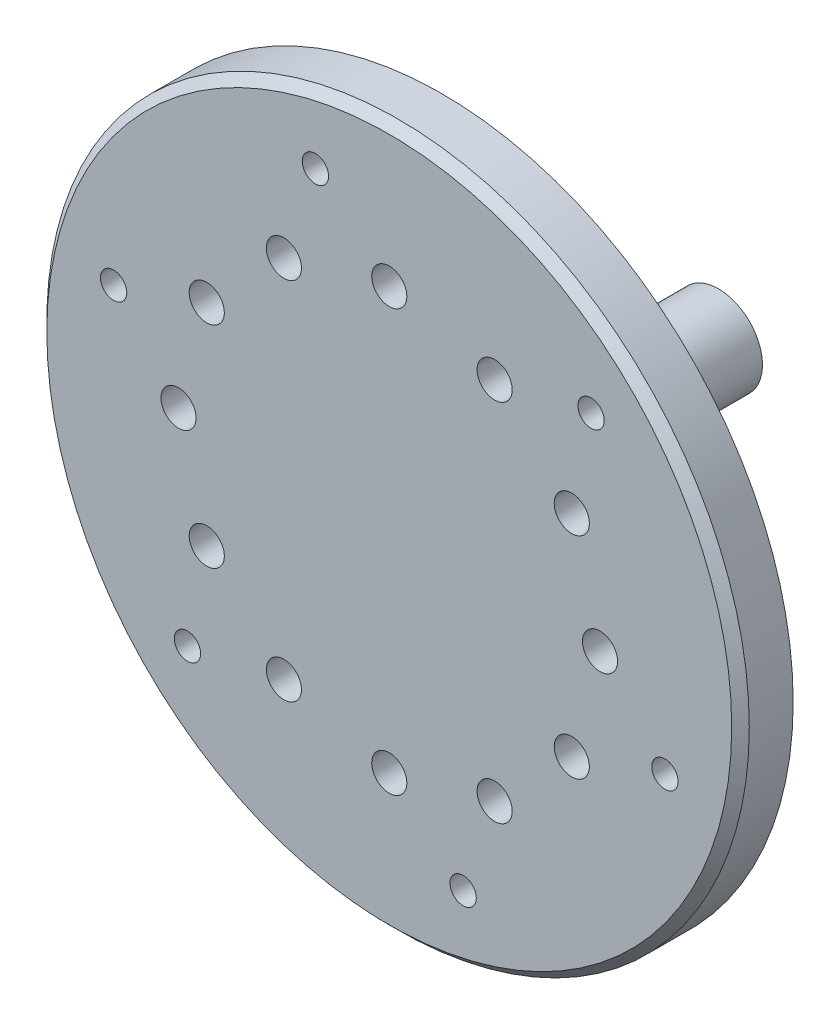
ISO-10303-21;
HEADER;
FILE_DESCRIPTION(('STEP AP214'),'2;1');
FILE_NAME('part.step','',(''),(''),'','','');
FILE_SCHEMA(('AUTOMOTIVE_DESIGN { 1 0 10303 214 1 1 1 1 }'));
ENDSEC;
DATA;
#1=APPLICATION_CONTEXT('core data for automotive mechanical design processes');
#2=APPLICATION_PROTOCOL_DEFINITION('international standard','automotive_design',2000,#1);
#3=PRODUCT_CONTEXT('',#1,'mechanical');
#4=PRODUCT('Part','Part','',(#3));
#5=PRODUCT_RELATED_PRODUCT_CATEGORY('part','',(#4));
#6=PRODUCT_DEFINITION_FORMATION('','',#4);
#7=PRODUCT_DEFINITION_CONTEXT('part definition',#1,'design');
#8=PRODUCT_DEFINITION('design','',#6,#7);
#9=PRODUCT_DEFINITION_SHAPE('','',#8);
#10=(LENGTH_UNIT() NAMED_UNIT(*) SI_UNIT(.MILLI.,.METRE.));
#11=(NAMED_UNIT(*) PLANE_ANGLE_UNIT() SI_UNIT($,.RADIAN.));
#12=(NAMED_UNIT(*) SI_UNIT($,.STERADIAN.) SOLID_ANGLE_UNIT());
#13=UNCERTAINTY_MEASURE_WITH_UNIT(LENGTH_MEASURE(1.E-05),#10,'distance_accuracy_value','');
#14=(GEOMETRIC_REPRESENTATION_CONTEXT(3) GLOBAL_UNCERTAINTY_ASSIGNED_CONTEXT((#13)) GLOBAL_UNIT_ASSIGNED_CONTEXT((#10,
#11,#12)) REPRESENTATION_CONTEXT('',''));
#15=CARTESIAN_POINT('',(0.,0.,0.));
#16=DIRECTION('',(0.,0.,1.));
#17=DIRECTION('',(1.,0.,0.));
#18=AXIS2_PLACEMENT_3D('',#15,#16,#17);
#19=CARTESIAN_POINT('',(0.,0.,-9.99999999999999));
#20=DIRECTION('',(0.,0.,-1.));
#21=DIRECTION('',(-1.,0.,0.));
#22=AXIS2_PLACEMENT_3D('',#19,#20,#21);
#23=PLANE('',#22);
#24=CARTESIAN_POINT('',(0.,0.,-9.99999999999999));
#25=DIRECTION('',(0.,0.,-1.));
#26=DIRECTION('',(-1.,0.,0.));
#27=AXIS2_PLACEMENT_3D('',#24,#25,#26);
#28=CIRCLE('',#27,12.5);
#29=CARTESIAN_POINT('',(-12.5,0.,-9.99999999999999));
#30=VERTEX_POINT('',#29);
#31=EDGE_CURVE('E42',#30,#30,#28,.T.);
#32=ORIENTED_EDGE('',*,*,#31,.T.);
#33=EDGE_LOOP('',(#32));
#34=FACE_BOUND('',#33,.T.);
#35=CARTESIAN_POINT('',(0.,0.,-9.99999999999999));
#36=DIRECTION('',(0.,0.,-1.));
#37=DIRECTION('',(-1.,0.,0.));
#38=AXIS2_PLACEMENT_3D('',#35,#36,#37);
#39=CIRCLE('',#38,10.);
#40=CARTESIAN_POINT('',(-10.,0.,-9.99999999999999));
#41=VERTEX_POINT('',#40);
#42=EDGE_CURVE('E156',#41,#41,#39,.T.);
#43=ORIENTED_EDGE('',*,*,#42,.F.);
#44=EDGE_LOOP('',(#43));
#45=FACE_BOUND('',#44,.T.);
#46=ADVANCED_FACE('F22',(#34,#45),#23,.T.);
#47=CARTESIAN_POINT('',(0.,0.,0.));
#48=DIRECTION('',(0.,0.,1.));
#49=DIRECTION('',(1.,0.,0.));
#50=AXIS2_PLACEMENT_3D('',#47,#48,#49);
#51=PLANE('',#50);
#52=CARTESIAN_POINT('',(-45.9619407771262,-45.961940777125,0.));
#53=DIRECTION('',(0.,0.,1.));
#54=DIRECTION('',(1.,0.,0.));
#55=AXIS2_PLACEMENT_3D('',#52,#53,#54);
#56=CIRCLE('',#55,3.);
#57=CARTESIAN_POINT('',(-42.9619407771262,-45.961940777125,0.));
#58=VERTEX_POINT('',#57);
#59=EDGE_CURVE('E147',#58,#58,#56,.T.);
#60=ORIENTED_EDGE('',*,*,#59,.T.);
#61=EDGE_LOOP('',(#60));
#62=FACE_BOUND('',#61,.T.);
#63=CARTESIAN_POINT('',(16.8232379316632,-62.7851787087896,0.));
#64=DIRECTION('',(0.,0.,1.));
#65=DIRECTION('',(1.,0.,0.));
#66=AXIS2_PLACEMENT_3D('',#63,#64,#65);
#67=CIRCLE('',#66,3.);
#68=CARTESIAN_POINT('',(19.8232379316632,-62.7851787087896,0.));
#69=VERTEX_POINT('',#68);
#70=EDGE_CURVE('E141',#69,#69,#67,.T.);
#71=ORIENTED_EDGE('',*,*,#70,.T.);
#72=EDGE_LOOP('',(#71));
#73=FACE_BOUND('',#72,.T.);
#74=CARTESIAN_POINT('',(62.7851787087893,-16.8232379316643,0.));
#75=DIRECTION('',(0.,0.,1.));
#76=DIRECTION('',(1.,0.,0.));
#77=AXIS2_PLACEMENT_3D('',#74,#75,#76);
#78=CIRCLE('',#77,3.);
#79=CARTESIAN_POINT('',(65.7851787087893,-16.8232379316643,0.));
#80=VERTEX_POINT('',#79);
#81=EDGE_CURVE('E135',#80,#80,#78,.T.);
#82=ORIENTED_EDGE('',*,*,#81,.T.);
#83=EDGE_LOOP('',(#82));
#84=FACE_BOUND('',#83,.T.);
#85=CARTESIAN_POINT('',(45.9619407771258,45.9619407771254,0.));
#86=DIRECTION('',(0.,0.,1.));
#87=DIRECTION('',(1.,0.,0.));
#88=AXIS2_PLACEMENT_3D('',#85,#86,#87);
#89=CIRCLE('',#88,3.);
#90=CARTESIAN_POINT('',(48.9619407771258,45.9619407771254,0.));
#91=VERTEX_POINT('',#90);
#92=EDGE_CURVE('E129',#91,#91,#89,.T.);
#93=ORIENTED_EDGE('',*,*,#92,.T.);
#94=EDGE_LOOP('',(#93));
#95=FACE_BOUND('',#94,.T.);
#96=CARTESIAN_POINT('',(-16.8232379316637,62.7851787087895,0.));
#97=DIRECTION('',(0.,0.,1.));
#98=DIRECTION('',(1.,0.,0.));
#99=AXIS2_PLACEMENT_3D('',#96,#97,#98);
#100=CIRCLE('',#99,3.);
#101=CARTESIAN_POINT('',(-13.8232379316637,62.7851787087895,0.));
#102=VERTEX_POINT('',#101);
#103=EDGE_CURVE('E123',#102,#102,#100,.T.);
#104=ORIENTED_EDGE('',*,*,#103,.T.);
#105=EDGE_LOOP('',(#104));
#106=FACE_BOUND('',#105,.T.);
#107=CARTESIAN_POINT('',(-62.7851787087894,16.8232379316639,0.));
#108=DIRECTION('',(0.,0.,1.));
#109=DIRECTION('',(1.,0.,0.));
#110=AXIS2_PLACEMENT_3D('',#107,#108,#109);
#111=CIRCLE('',#110,3.);
#112=CARTESIAN_POINT('',(-59.7851787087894,16.8232379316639,0.));
#113=VERTEX_POINT('',#112);
#114=EDGE_CURVE('E117',#113,#113,#111,.T.);
#115=ORIENTED_EDGE('',*,*,#114,.T.);
#116=EDGE_LOOP('',(#115));
#117=FACE_BOUND('',#116,.T.);
#118=CARTESIAN_POINT('',(-41.5692193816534,23.9999999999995,0.));
#119=DIRECTION('',(0.,0.,1.));
#120=DIRECTION('',(1.,0.,0.));
#121=AXIS2_PLACEMENT_3D('',#118,#119,#120);
#122=CIRCLE('',#121,4.);
#123=CARTESIAN_POINT('',(-37.5692193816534,23.9999999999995,0.));
#124=VERTEX_POINT('',#123);
#125=EDGE_CURVE('E111',#124,#124,#122,.T.);
#126=ORIENTED_EDGE('',*,*,#125,.T.);
#127=EDGE_LOOP('',(#126));
#128=FACE_BOUND('',#127,.T.);
#129=CARTESIAN_POINT('',(-24.0000000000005,41.5692193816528,0.));
#130=DIRECTION('',(0.,0.,1.));
#131=DIRECTION('',(1.,0.,0.));
#132=AXIS2_PLACEMENT_3D('',#129,#130,#131);
#133=CIRCLE('',#132,4.);
#134=CARTESIAN_POINT('',(-20.0000000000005,41.5692193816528,0.));
#135=VERTEX_POINT('',#134);
#136=EDGE_CURVE('E105',#135,#135,#133,.T.);
#137=ORIENTED_EDGE('',*,*,#136,.T.);
#138=EDGE_LOOP('',(#137));
#139=FACE_BOUND('',#138,.T.);
#140=CARTESIAN_POINT('',(-5.02773603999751E-13,48.,0.));
#141=DIRECTION('',(0.,0.,1.));
#142=DIRECTION('',(1.,0.,0.));
#143=AXIS2_PLACEMENT_3D('',#140,#141,#142);
#144=CIRCLE('',#143,4.);
#145=CARTESIAN_POINT('',(3.9999999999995,48.,0.));
#146=VERTEX_POINT('',#145);
#147=EDGE_CURVE('E99',#146,#146,#144,.T.);
#148=ORIENTED_EDGE('',*,*,#147,.T.);
#149=EDGE_LOOP('',(#148));
#150=FACE_BOUND('',#149,.T.);
#151=CARTESIAN_POINT('',(23.9999999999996,41.5692193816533,0.));
#152=DIRECTION('',(0.,0.,1.));
#153=DIRECTION('',(1.,0.,0.));
#154=AXIS2_PLACEMENT_3D('',#151,#152,#153);
#155=CIRCLE('',#154,4.);
#156=CARTESIAN_POINT('',(27.9999999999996,41.5692193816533,0.));
#157=VERTEX_POINT('',#156);
#158=EDGE_CURVE('E93',#157,#157,#155,.T.);
#159=ORIENTED_EDGE('',*,*,#158,.T.);
#160=EDGE_LOOP('',(#159));
#161=FACE_BOUND('',#160,.T.);
#162=CARTESIAN_POINT('',(41.5692193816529,24.0000000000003,0.));
#163=DIRECTION('',(0.,0.,1.));
#164=DIRECTION('',(1.,0.,0.));
#165=AXIS2_PLACEMENT_3D('',#162,#163,#164);
#166=CIRCLE('',#165,4.);
#167=CARTESIAN_POINT('',(45.5692193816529,24.0000000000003,0.));
#168=VERTEX_POINT('',#167);
#169=EDGE_CURVE('E87',#168,#168,#166,.T.);
#170=ORIENTED_EDGE('',*,*,#169,.T.);
#171=EDGE_LOOP('',(#170));
#172=FACE_BOUND('',#171,.T.);
#173=CARTESIAN_POINT('',(48.,3.35182402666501E-13,0.));
#174=DIRECTION('',(0.,0.,1.));
#175=DIRECTION('',(1.,0.,0.));
#176=AXIS2_PLACEMENT_3D('',#173,#174,#175);
#177=CIRCLE('',#176,4.);
#178=CARTESIAN_POINT('',(52.,3.35182402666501E-13,0.));
#179=VERTEX_POINT('',#178);
#180=EDGE_CURVE('E81',#179,#179,#177,.T.);
#181=ORIENTED_EDGE('',*,*,#180,.T.);
#182=EDGE_LOOP('',(#181));
#183=FACE_BOUND('',#182,.T.);
#184=CARTESIAN_POINT('',(41.5692193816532,-23.9999999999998,0.));
#185=DIRECTION('',(0.,0.,1.));
#186=DIRECTION('',(1.,0.,0.));
#187=AXIS2_PLACEMENT_3D('',#184,#185,#186);
#188=CIRCLE('',#187,4.);
#189=CARTESIAN_POINT('',(45.5692193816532,-23.9999999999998,0.));
#190=VERTEX_POINT('',#189);
#191=EDGE_CURVE('E75',#190,#190,#188,.T.);
#192=ORIENTED_EDGE('',*,*,#191,.T.);
#193=EDGE_LOOP('',(#192));
#194=FACE_BOUND('',#193,.T.);
#195=CARTESIAN_POINT('',(24.0000000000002,-41.5692193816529,0.));
#196=DIRECTION('',(0.,0.,1.));
#197=DIRECTION('',(1.,0.,0.));
#198=AXIS2_PLACEMENT_3D('',#195,#196,#197);
#199=CIRCLE('',#198,4.);
#200=CARTESIAN_POINT('',(28.0000000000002,-41.5692193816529,0.));
#201=VERTEX_POINT('',#200);
#202=EDGE_CURVE('E69',#201,#201,#199,.T.);
#203=ORIENTED_EDGE('',*,*,#202,.T.);
#204=EDGE_LOOP('',(#203));
#205=FACE_BOUND('',#204,.T.);
#206=CARTESIAN_POINT('',(1.6759120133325E-13,-48.,0.));
#207=DIRECTION('',(0.,0.,1.));
#208=DIRECTION('',(1.,0.,0.));
#209=AXIS2_PLACEMENT_3D('',#206,#207,#208);
#210=CIRCLE('',#209,4.);
#211=CARTESIAN_POINT('',(4.00000000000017,-48.,0.));
#212=VERTEX_POINT('',#211);
#213=EDGE_CURVE('E63',#212,#212,#210,.T.);
#214=ORIENTED_EDGE('',*,*,#213,.T.);
#215=EDGE_LOOP('',(#214));
#216=FACE_BOUND('',#215,.T.);
#217=CARTESIAN_POINT('',(-23.9999999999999,-41.5692193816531,0.));
#218=DIRECTION('',(0.,0.,1.));
#219=DIRECTION('',(1.,0.,0.));
#220=AXIS2_PLACEMENT_3D('',#217,#218,#219);
#221=CIRCLE('',#220,4.);
#222=CARTESIAN_POINT('',(-19.9999999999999,-41.5692193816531,0.));
#223=VERTEX_POINT('',#222);
#224=EDGE_CURVE('E57',#223,#223,#221,.T.);
#225=ORIENTED_EDGE('',*,*,#224,.T.);
#226=EDGE_LOOP('',(#225));
#227=FACE_BOUND('',#226,.T.);
#228=CARTESIAN_POINT('',(-41.569219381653,-24.0000000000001,0.));
#229=DIRECTION('',(0.,0.,1.));
#230=DIRECTION('',(1.,0.,0.));
#231=AXIS2_PLACEMENT_3D('',#228,#229,#230);
#232=CIRCLE('',#231,4.);
#233=CARTESIAN_POINT('',(-37.569219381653,-24.0000000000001,0.));
#234=VERTEX_POINT('',#233);
#235=EDGE_CURVE('E51',#234,#234,#232,.T.);
#236=ORIENTED_EDGE('',*,*,#235,.T.);
#237=EDGE_LOOP('',(#236));
#238=FACE_BOUND('',#237,.T.);
#239=CARTESIAN_POINT('',(-48.,0.,0.));
#240=DIRECTION('',(0.,0.,1.));
#241=DIRECTION('',(1.,0.,0.));
#242=AXIS2_PLACEMENT_3D('',#239,#240,#241);
#243=CIRCLE('',#242,4.);
#244=CARTESIAN_POINT('',(-44.,0.,0.));
#245=VERTEX_POINT('',#244);
#246=EDGE_CURVE('E45',#245,#245,#243,.T.);
#247=ORIENTED_EDGE('',*,*,#246,.T.);
#248=EDGE_LOOP('',(#247));
#249=FACE_BOUND('',#248,.T.);
#250=CARTESIAN_POINT('',(0.,0.,0.));
#251=DIRECTION('',(0.,0.,1.));
#252=DIRECTION('',(1.,0.,0.));
#253=AXIS2_PLACEMENT_3D('',#250,#251,#252);
#254=CIRCLE('',#253,80.);
#255=CARTESIAN_POINT('',(80.,0.,0.));
#256=VERTEX_POINT('',#255);
#257=EDGE_CURVE('E37',#256,#256,#254,.T.);
#258=ORIENTED_EDGE('',*,*,#257,.F.);
#259=EDGE_LOOP('',(#258));
#260=FACE_BOUND('',#259,.T.);
#261=CARTESIAN_POINT('',(0.,0.,0.));
#262=DIRECTION('',(0.,0.,1.));
#263=DIRECTION('',(1.,0.,0.));
#264=AXIS2_PLACEMENT_3D('',#261,#262,#263);
#265=CIRCLE('',#264,12.5);
#266=CARTESIAN_POINT('',(12.5,0.,0.));
#267=VERTEX_POINT('',#266);
#268=EDGE_CURVE('E10',#267,#267,#265,.F.);
#269=ORIENTED_EDGE('',*,*,#268,.F.);
#270=EDGE_LOOP('',(#269));
#271=FACE_BOUND('',#270,.T.);
#272=ADVANCED_FACE('F163',(#62,#73,#84,#95,#106,#117,#128,#139,#150,#161,#172,#183,#194,#205,
#216,#227,#238,#249,#260,#271),#51,.F.);
#273=CARTESIAN_POINT('',(0.,0.,12.));
#274=DIRECTION('',(0.,0.,-1.));
#275=DIRECTION('',(-1.,0.,0.));
#276=AXIS2_PLACEMENT_3D('',#273,#274,#275);
#277=CYLINDRICAL_SURFACE('',#276,80.);
#278=CARTESIAN_POINT('',(0.,0.,9.99999999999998));
#279=DIRECTION('',(0.,0.,1.));
#280=DIRECTION('',(1.,0.,0.));
#281=AXIS2_PLACEMENT_3D('',#278,#279,#280);
#282=CIRCLE('',#281,80.);
#283=CARTESIAN_POINT('',(80.,0.,9.99999999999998));
#284=VERTEX_POINT('',#283);
#285=EDGE_CURVE('E29',#284,#284,#282,.F.);
#286=ORIENTED_EDGE('',*,*,#285,.T.);
#287=EDGE_LOOP('',(#286));
#288=FACE_BOUND('',#287,.T.);
#289=ORIENTED_EDGE('',*,*,#257,.T.);
#290=EDGE_LOOP('',(#289));
#291=FACE_BOUND('',#290,.T.);
#292=ADVANCED_FACE('F24',(#288,#291),#277,.T.);
#293=CARTESIAN_POINT('',(0.,0.,12.));
#294=DIRECTION('',(0.,0.,1.));
#295=DIRECTION('',(1.,0.,0.));
#296=AXIS2_PLACEMENT_3D('',#293,#294,#295);
#297=PLANE('',#296);
#298=CARTESIAN_POINT('',(-45.9619407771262,-45.961940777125,12.));
#299=DIRECTION('',(0.,0.,1.));
#300=DIRECTION('',(0.50000000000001,0.866025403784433,0.));
#301=AXIS2_PLACEMENT_3D('',#298,#299,#300);
#302=CIRCLE('',#301,3.);
#303=CARTESIAN_POINT('',(-44.4619407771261,-43.3638645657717,12.));
#304=VERTEX_POINT('',#303);
#305=EDGE_CURVE('E150',#304,#304,#302,.T.);
#306=ORIENTED_EDGE('',*,*,#305,.F.);
#307=EDGE_LOOP('',(#306));
#308=FACE_BOUND('',#307,.T.);
#309=CARTESIAN_POINT('',(16.8232379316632,-62.7851787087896,12.));
#310=DIRECTION('',(0.,0.,1.));
#311=DIRECTION('',(-0.499999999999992,0.866025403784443,0.));
#312=AXIS2_PLACEMENT_3D('',#309,#310,#311);
#313=CIRCLE('',#312,3.);
#314=CARTESIAN_POINT('',(15.3232379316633,-60.1871024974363,12.));
#315=VERTEX_POINT('',#314);
#316=EDGE_CURVE('E144',#315,#315,#313,.T.);
#317=ORIENTED_EDGE('',*,*,#316,.F.);
#318=EDGE_LOOP('',(#317));
#319=FACE_BOUND('',#318,.T.);
#320=CARTESIAN_POINT('',(62.7851787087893,-16.8232379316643,12.));
#321=DIRECTION('',(0.,0.,1.));
#322=DIRECTION('',(-1.,0.,0.));
#323=AXIS2_PLACEMENT_3D('',#320,#321,#322);
#324=CIRCLE('',#323,3.);
#325=CARTESIAN_POINT('',(59.7851787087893,-16.8232379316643,12.));
#326=VERTEX_POINT('',#325);
#327=EDGE_CURVE('E138',#326,#326,#324,.T.);
#328=ORIENTED_EDGE('',*,*,#327,.F.);
#329=EDGE_LOOP('',(#328));
#330=FACE_BOUND('',#329,.T.);
#331=CARTESIAN_POINT('',(45.9619407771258,45.9619407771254,12.));
#332=DIRECTION('',(0.,0.,1.));
#333=DIRECTION('',(-0.500000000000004,-0.866025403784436,0.));
#334=AXIS2_PLACEMENT_3D('',#331,#332,#333);
#335=CIRCLE('',#334,3.);
#336=CARTESIAN_POINT('',(44.4619407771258,43.363864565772,12.));
#337=VERTEX_POINT('',#336);
#338=EDGE_CURVE('E132',#337,#337,#335,.T.);
#339=ORIENTED_EDGE('',*,*,#338,.F.);
#340=EDGE_LOOP('',(#339));
#341=FACE_BOUND('',#340,.T.);
#342=CARTESIAN_POINT('',(-16.8232379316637,62.7851787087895,12.));
#343=DIRECTION('',(0.,0.,1.));
#344=DIRECTION('',(0.499999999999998,-0.86602540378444,0.));
#345=AXIS2_PLACEMENT_3D('',#342,#343,#344);
#346=CIRCLE('',#345,3.);
#347=CARTESIAN_POINT('',(-15.3232379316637,60.1871024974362,12.));
#348=VERTEX_POINT('',#347);
#349=EDGE_CURVE('E126',#348,#348,#346,.T.);
#350=ORIENTED_EDGE('',*,*,#349,.F.);
#351=EDGE_LOOP('',(#350));
#352=FACE_BOUND('',#351,.T.);
#353=CARTESIAN_POINT('',(-62.7851787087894,16.8232379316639,12.));
#354=DIRECTION('',(0.,0.,1.));
#355=DIRECTION('',(1.,0.,0.));
#356=AXIS2_PLACEMENT_3D('',#353,#354,#355);
#357=CIRCLE('',#356,3.);
#358=CARTESIAN_POINT('',(-59.7851787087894,16.8232379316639,12.));
#359=VERTEX_POINT('',#358);
#360=EDGE_CURVE('E120',#359,#359,#357,.T.);
#361=ORIENTED_EDGE('',*,*,#360,.F.);
#362=EDGE_LOOP('',(#361));
#363=FACE_BOUND('',#362,.T.);
#364=CARTESIAN_POINT('',(-41.5692193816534,23.9999999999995,12.));
#365=DIRECTION('',(0.,0.,1.));
#366=DIRECTION('',(0.866025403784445,-0.499999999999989,0.));
#367=AXIS2_PLACEMENT_3D('',#364,#365,#366);
#368=CIRCLE('',#367,4.);
#369=CARTESIAN_POINT('',(-38.1051177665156,21.9999999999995,12.));
#370=VERTEX_POINT('',#369);
#371=EDGE_CURVE('E114',#370,#370,#368,.T.);
#372=ORIENTED_EDGE('',*,*,#371,.F.);
#373=EDGE_LOOP('',(#372));
#374=FACE_BOUND('',#373,.T.);
#375=CARTESIAN_POINT('',(-24.0000000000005,41.5692193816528,12.));
#376=DIRECTION('',(0.,0.,1.));
#377=DIRECTION('',(0.50000000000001,-0.866025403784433,0.));
#378=AXIS2_PLACEMENT_3D('',#375,#376,#377);
#379=CIRCLE('',#378,4.);
#380=CARTESIAN_POINT('',(-22.0000000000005,38.1051177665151,12.));
#381=VERTEX_POINT('',#380);
#382=EDGE_CURVE('E108',#381,#381,#379,.T.);
#383=ORIENTED_EDGE('',*,*,#382,.F.);
#384=EDGE_LOOP('',(#383));
#385=FACE_BOUND('',#384,.T.);
#386=CARTESIAN_POINT('',(-5.02773603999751E-13,48.,12.));
#387=DIRECTION('',(0.,0.,1.));
#388=DIRECTION('',(0.,-1.,0.));
#389=AXIS2_PLACEMENT_3D('',#386,#387,#388);
#390=CIRCLE('',#389,4.);
#391=CARTESIAN_POINT('',(-4.60875803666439E-13,44.,12.));
#392=VERTEX_POINT('',#391);
#393=EDGE_CURVE('E102',#392,#392,#390,.T.);
#394=ORIENTED_EDGE('',*,*,#393,.F.);
#395=EDGE_LOOP('',(#394));
#396=FACE_BOUND('',#395,.T.);
#397=CARTESIAN_POINT('',(23.9999999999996,41.5692193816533,12.));
#398=DIRECTION('',(0.,0.,1.));
#399=DIRECTION('',(-0.499999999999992,-0.866025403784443,0.));
#400=AXIS2_PLACEMENT_3D('',#397,#398,#399);
#401=CIRCLE('',#400,4.);
#402=CARTESIAN_POINT('',(21.9999999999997,38.1051177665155,12.));
#403=VERTEX_POINT('',#402);
#404=EDGE_CURVE('E96',#403,#403,#401,.T.);
#405=ORIENTED_EDGE('',*,*,#404,.F.);
#406=EDGE_LOOP('',(#405));
#407=FACE_BOUND('',#406,.T.);
#408=CARTESIAN_POINT('',(41.5692193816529,24.0000000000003,12.));
#409=DIRECTION('',(0.,0.,1.));
#410=DIRECTION('',(-0.866025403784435,-0.500000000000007,0.));
#411=AXIS2_PLACEMENT_3D('',#408,#409,#410);
#412=CIRCLE('',#411,4.);
#413=CARTESIAN_POINT('',(38.1051177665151,22.0000000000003,12.));
#414=VERTEX_POINT('',#413);
#415=EDGE_CURVE('E90',#414,#414,#412,.T.);
#416=ORIENTED_EDGE('',*,*,#415,.F.);
#417=EDGE_LOOP('',(#416));
#418=FACE_BOUND('',#417,.T.);
#419=CARTESIAN_POINT('',(48.,3.35182402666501E-13,12.));
#420=DIRECTION('',(0.,0.,1.));
#421=DIRECTION('',(-1.,0.,0.));
#422=AXIS2_PLACEMENT_3D('',#419,#420,#421);
#423=CIRCLE('',#422,4.);
#424=CARTESIAN_POINT('',(44.,3.07250535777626E-13,12.));
#425=VERTEX_POINT('',#424);
#426=EDGE_CURVE('E84',#425,#425,#423,.T.);
#427=ORIENTED_EDGE('',*,*,#426,.F.);
#428=EDGE_LOOP('',(#427));
#429=FACE_BOUND('',#428,.T.);
#430=CARTESIAN_POINT('',(41.5692193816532,-23.9999999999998,12.));
#431=DIRECTION('',(0.,0.,1.));
#432=DIRECTION('',(-0.866025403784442,0.499999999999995,0.));
#433=AXIS2_PLACEMENT_3D('',#430,#431,#432);
#434=CIRCLE('',#433,4.);
#435=CARTESIAN_POINT('',(38.1051177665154,-21.9999999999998,12.));
#436=VERTEX_POINT('',#435);
#437=EDGE_CURVE('E78',#436,#436,#434,.T.);
#438=ORIENTED_EDGE('',*,*,#437,.F.);
#439=EDGE_LOOP('',(#438));
#440=FACE_BOUND('',#439,.T.);
#441=CARTESIAN_POINT('',(24.0000000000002,-41.5692193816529,12.));
#442=DIRECTION('',(0.,0.,1.));
#443=DIRECTION('',(-0.500000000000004,0.866025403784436,0.));
#444=AXIS2_PLACEMENT_3D('',#441,#442,#443);
#445=CIRCLE('',#444,4.);
#446=CARTESIAN_POINT('',(22.0000000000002,-38.1051177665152,12.));
#447=VERTEX_POINT('',#446);
#448=EDGE_CURVE('E72',#447,#447,#445,.T.);
#449=ORIENTED_EDGE('',*,*,#448,.F.);
#450=EDGE_LOOP('',(#449));
#451=FACE_BOUND('',#450,.T.);
#452=CARTESIAN_POINT('',(1.6759120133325E-13,-48.,12.));
#453=DIRECTION('',(0.,0.,1.));
#454=DIRECTION('',(0.,1.,0.));
#455=AXIS2_PLACEMENT_3D('',#452,#453,#454);
#456=CIRCLE('',#455,4.);
#457=CARTESIAN_POINT('',(1.53625267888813E-13,-44.,12.));
#458=VERTEX_POINT('',#457);
#459=EDGE_CURVE('E66',#458,#458,#456,.T.);
#460=ORIENTED_EDGE('',*,*,#459,.F.);
#461=EDGE_LOOP('',(#460));
#462=FACE_BOUND('',#461,.T.);
#463=CARTESIAN_POINT('',(-23.9999999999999,-41.5692193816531,12.));
#464=DIRECTION('',(0.,0.,1.));
#465=DIRECTION('',(0.499999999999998,0.86602540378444,0.));
#466=AXIS2_PLACEMENT_3D('',#463,#464,#465);
#467=CIRCLE('',#466,4.);
#468=CARTESIAN_POINT('',(-21.9999999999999,-38.1051177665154,12.));
#469=VERTEX_POINT('',#468);
#470=EDGE_CURVE('E60',#469,#469,#467,.T.);
#471=ORIENTED_EDGE('',*,*,#470,.F.);
#472=EDGE_LOOP('',(#471));
#473=FACE_BOUND('',#472,.T.);
#474=CARTESIAN_POINT('',(-41.569219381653,-24.0000000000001,12.));
#475=DIRECTION('',(0.,0.,1.));
#476=DIRECTION('',(0.866025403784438,0.500000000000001,0.));
#477=AXIS2_PLACEMENT_3D('',#474,#475,#476);
#478=CIRCLE('',#477,4.);
#479=CARTESIAN_POINT('',(-38.1051177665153,-22.,12.));
#480=VERTEX_POINT('',#479);
#481=EDGE_CURVE('E54',#480,#480,#478,.T.);
#482=ORIENTED_EDGE('',*,*,#481,.F.);
#483=EDGE_LOOP('',(#482));
#484=FACE_BOUND('',#483,.T.);
#485=CARTESIAN_POINT('',(-48.,0.,12.));
#486=DIRECTION('',(0.,0.,1.));
#487=DIRECTION('',(1.,0.,0.));
#488=AXIS2_PLACEMENT_3D('',#485,#486,#487);
#489=CIRCLE('',#488,4.);
#490=CARTESIAN_POINT('',(-44.,0.,12.));
#491=VERTEX_POINT('',#490);
#492=EDGE_CURVE('E48',#491,#491,#489,.T.);
#493=ORIENTED_EDGE('',*,*,#492,.F.);
#494=EDGE_LOOP('',(#493));
#495=FACE_BOUND('',#494,.T.);
#496=CARTESIAN_POINT('',(0.,0.,12.));
#497=DIRECTION('',(0.,0.,1.));
#498=DIRECTION('',(1.,0.,0.));
#499=AXIS2_PLACEMENT_3D('',#496,#497,#498);
#500=CIRCLE('',#499,78.);
#501=CARTESIAN_POINT('',(78.,0.,12.));
#502=VERTEX_POINT('',#501);
#503=EDGE_CURVE('E33',#502,#502,#500,.T.);
#504=ORIENTED_EDGE('',*,*,#503,.T.);
#505=EDGE_LOOP('',(#504));
#506=FACE_BOUND('',#505,.T.);
#507=ADVANCED_FACE('F181',(#308,#319,#330,#341,#352,#363,#374,#385,#396,#407,#418,#429,#440,
#451,#462,#473,#484,#495,#506),#297,.T.);
#508=CARTESIAN_POINT('',(0.,0.,12.));
#509=DIRECTION('',(0.,0.,-1.));
#510=DIRECTION('',(-1.,0.,0.));
#511=AXIS2_PLACEMENT_3D('',#508,#509,#510);
#512=CONICAL_SURFACE('',#511,78.,0.785398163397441);
#513=ORIENTED_EDGE('',*,*,#285,.F.);
#514=EDGE_LOOP('',(#513));
#515=FACE_BOUND('',#514,.T.);
#516=ORIENTED_EDGE('',*,*,#503,.F.);
#517=EDGE_LOOP('',(#516));
#518=FACE_BOUND('',#517,.T.);
#519=ADVANCED_FACE('F178',(#515,#518),#512,.T.);
#520=CARTESIAN_POINT('',(0.,0.,-9.99999999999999));
#521=DIRECTION('',(0.,0.,1.));
#522=DIRECTION('',(1.,0.,0.));
#523=AXIS2_PLACEMENT_3D('',#520,#521,#522);
#524=CYLINDRICAL_SURFACE('',#523,12.5);
#525=ORIENTED_EDGE('',*,*,#31,.F.);
#526=EDGE_LOOP('',(#525));
#527=FACE_BOUND('',#526,.T.);
#528=ORIENTED_EDGE('',*,*,#268,.T.);
#529=EDGE_LOOP('',(#528));
#530=FACE_BOUND('',#529,.T.);
#531=ADVANCED_FACE('F175',(#527,#530),#524,.T.);
#532=CARTESIAN_POINT('',(-48.,0.,-9.99999999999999));
#533=DIRECTION('',(0.,0.,1.));
#534=DIRECTION('',(1.,0.,0.));
#535=AXIS2_PLACEMENT_3D('',#532,#533,#534);
#536=CYLINDRICAL_SURFACE('',#535,4.);
#537=ORIENTED_EDGE('',*,*,#492,.T.);
#538=EDGE_LOOP('',(#537));
#539=FACE_BOUND('',#538,.T.);
#540=ORIENTED_EDGE('',*,*,#246,.F.);
#541=EDGE_LOOP('',(#540));
#542=FACE_BOUND('',#541,.T.);
#543=ADVANCED_FACE('F173',(#539,#542),#536,.F.);
#544=CARTESIAN_POINT('',(-41.569219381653,-24.0000000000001,-9.99999999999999));
#545=DIRECTION('',(0.,0.,1.));
#546=DIRECTION('',(1.,0.,0.));
#547=AXIS2_PLACEMENT_3D('',#544,#545,#546);
#548=CYLINDRICAL_SURFACE('',#547,4.);
#549=ORIENTED_EDGE('',*,*,#481,.T.);
#550=EDGE_LOOP('',(#549));
#551=FACE_BOUND('',#550,.T.);
#552=ORIENTED_EDGE('',*,*,#235,.F.);
#553=EDGE_LOOP('',(#552));
#554=FACE_BOUND('',#553,.T.);
#555=ADVANCED_FACE('F229',(#551,#554),#548,.F.);
#556=CARTESIAN_POINT('',(-23.9999999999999,-41.5692193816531,-9.99999999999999));
#557=DIRECTION('',(0.,0.,1.));
#558=DIRECTION('',(1.,0.,0.));
#559=AXIS2_PLACEMENT_3D('',#556,#557,#558);
#560=CYLINDRICAL_SURFACE('',#559,4.);
#561=ORIENTED_EDGE('',*,*,#470,.T.);
#562=EDGE_LOOP('',(#561));
#563=FACE_BOUND('',#562,.T.);
#564=ORIENTED_EDGE('',*,*,#224,.F.);
#565=EDGE_LOOP('',(#564));
#566=FACE_BOUND('',#565,.T.);
#567=ADVANCED_FACE('F239',(#563,#566),#560,.F.);
#568=CARTESIAN_POINT('',(1.6759120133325E-13,-48.,-9.99999999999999));
#569=DIRECTION('',(0.,0.,1.));
#570=DIRECTION('',(1.,0.,0.));
#571=AXIS2_PLACEMENT_3D('',#568,#569,#570);
#572=CYLINDRICAL_SURFACE('',#571,4.);
#573=ORIENTED_EDGE('',*,*,#459,.T.);
#574=EDGE_LOOP('',(#573));
#575=FACE_BOUND('',#574,.T.);
#576=ORIENTED_EDGE('',*,*,#213,.F.);
#577=EDGE_LOOP('',(#576));
#578=FACE_BOUND('',#577,.T.);
#579=ADVANCED_FACE('F244',(#575,#578),#572,.F.);
#580=CARTESIAN_POINT('',(24.0000000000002,-41.5692193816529,-9.99999999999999));
#581=DIRECTION('',(0.,0.,1.));
#582=DIRECTION('',(1.,0.,0.));
#583=AXIS2_PLACEMENT_3D('',#580,#581,#582);
#584=CYLINDRICAL_SURFACE('',#583,4.);
#585=ORIENTED_EDGE('',*,*,#448,.T.);
#586=EDGE_LOOP('',(#585));
#587=FACE_BOUND('',#586,.T.);
#588=ORIENTED_EDGE('',*,*,#202,.F.);
#589=EDGE_LOOP('',(#588));
#590=FACE_BOUND('',#589,.T.);
#591=ADVANCED_FACE('F251',(#587,#590),#584,.F.);
#592=CARTESIAN_POINT('',(41.5692193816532,-23.9999999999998,-9.99999999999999));
#593=DIRECTION('',(0.,0.,1.));
#594=DIRECTION('',(1.,0.,0.));
#595=AXIS2_PLACEMENT_3D('',#592,#593,#594);
#596=CYLINDRICAL_SURFACE('',#595,4.);
#597=ORIENTED_EDGE('',*,*,#437,.T.);
#598=EDGE_LOOP('',(#597));
#599=FACE_BOUND('',#598,.T.);
#600=ORIENTED_EDGE('',*,*,#191,.F.);
#601=EDGE_LOOP('',(#600));
#602=FACE_BOUND('',#601,.T.);
#603=ADVANCED_FACE('F255',(#599,#602),#596,.F.);
#604=CARTESIAN_POINT('',(48.,3.35182402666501E-13,-9.99999999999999));
#605=DIRECTION('',(0.,0.,1.));
#606=DIRECTION('',(1.,0.,0.));
#607=AXIS2_PLACEMENT_3D('',#604,#605,#606);
#608=CYLINDRICAL_SURFACE('',#607,4.);
#609=ORIENTED_EDGE('',*,*,#426,.T.);
#610=EDGE_LOOP('',(#609));
#611=FACE_BOUND('',#610,.T.);
#612=ORIENTED_EDGE('',*,*,#180,.F.);
#613=EDGE_LOOP('',(#612));
#614=FACE_BOUND('',#613,.T.);
#615=ADVANCED_FACE('F259',(#611,#614),#608,.F.);
#616=CARTESIAN_POINT('',(41.5692193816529,24.0000000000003,-9.99999999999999));
#617=DIRECTION('',(0.,0.,1.));
#618=DIRECTION('',(1.,0.,0.));
#619=AXIS2_PLACEMENT_3D('',#616,#617,#618);
#620=CYLINDRICAL_SURFACE('',#619,4.);
#621=ORIENTED_EDGE('',*,*,#415,.T.);
#622=EDGE_LOOP('',(#621));
#623=FACE_BOUND('',#622,.T.);
#624=ORIENTED_EDGE('',*,*,#169,.F.);
#625=EDGE_LOOP('',(#624));
#626=FACE_BOUND('',#625,.T.);
#627=ADVANCED_FACE('F263',(#623,#626),#620,.F.);
#628=CARTESIAN_POINT('',(23.9999999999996,41.5692193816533,-9.99999999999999));
#629=DIRECTION('',(0.,0.,1.));
#630=DIRECTION('',(1.,0.,0.));
#631=AXIS2_PLACEMENT_3D('',#628,#629,#630);
#632=CYLINDRICAL_SURFACE('',#631,4.);
#633=ORIENTED_EDGE('',*,*,#404,.T.);
#634=EDGE_LOOP('',(#633));
#635=FACE_BOUND('',#634,.T.);
#636=ORIENTED_EDGE('',*,*,#158,.F.);
#637=EDGE_LOOP('',(#636));
#638=FACE_BOUND('',#637,.T.);
#639=ADVANCED_FACE('F267',(#635,#638),#632,.F.);
#640=CARTESIAN_POINT('',(-5.02773603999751E-13,48.,-9.99999999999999));
#641=DIRECTION('',(0.,0.,1.));
#642=DIRECTION('',(1.,0.,0.));
#643=AXIS2_PLACEMENT_3D('',#640,#641,#642);
#644=CYLINDRICAL_SURFACE('',#643,4.);
#645=ORIENTED_EDGE('',*,*,#393,.T.);
#646=EDGE_LOOP('',(#645));
#647=FACE_BOUND('',#646,.T.);
#648=ORIENTED_EDGE('',*,*,#147,.F.);
#649=EDGE_LOOP('',(#648));
#650=FACE_BOUND('',#649,.T.);
#651=ADVANCED_FACE('F271',(#647,#650),#644,.F.);
#652=CARTESIAN_POINT('',(-24.0000000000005,41.5692193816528,-9.99999999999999));
#653=DIRECTION('',(0.,0.,1.));
#654=DIRECTION('',(1.,0.,0.));
#655=AXIS2_PLACEMENT_3D('',#652,#653,#654);
#656=CYLINDRICAL_SURFACE('',#655,4.);
#657=ORIENTED_EDGE('',*,*,#382,.T.);
#658=EDGE_LOOP('',(#657));
#659=FACE_BOUND('',#658,.T.);
#660=ORIENTED_EDGE('',*,*,#136,.F.);
#661=EDGE_LOOP('',(#660));
#662=FACE_BOUND('',#661,.T.);
#663=ADVANCED_FACE('F275',(#659,#662),#656,.F.);
#664=CARTESIAN_POINT('',(-41.5692193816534,23.9999999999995,-9.99999999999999));
#665=DIRECTION('',(0.,0.,1.));
#666=DIRECTION('',(1.,0.,0.));
#667=AXIS2_PLACEMENT_3D('',#664,#665,#666);
#668=CYLINDRICAL_SURFACE('',#667,4.);
#669=ORIENTED_EDGE('',*,*,#371,.T.);
#670=EDGE_LOOP('',(#669));
#671=FACE_BOUND('',#670,.T.);
#672=ORIENTED_EDGE('',*,*,#125,.F.);
#673=EDGE_LOOP('',(#672));
#674=FACE_BOUND('',#673,.T.);
#675=ADVANCED_FACE('F279',(#671,#674),#668,.F.);
#676=CARTESIAN_POINT('',(-62.7851787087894,16.8232379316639,-9.99999999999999));
#677=DIRECTION('',(0.,0.,1.));
#678=DIRECTION('',(1.,0.,0.));
#679=AXIS2_PLACEMENT_3D('',#676,#677,#678);
#680=CYLINDRICAL_SURFACE('',#679,3.);
#681=ORIENTED_EDGE('',*,*,#360,.T.);
#682=EDGE_LOOP('',(#681));
#683=FACE_BOUND('',#682,.T.);
#684=ORIENTED_EDGE('',*,*,#114,.F.);
#685=EDGE_LOOP('',(#684));
#686=FACE_BOUND('',#685,.T.);
#687=ADVANCED_FACE('F283',(#683,#686),#680,.F.);
#688=CARTESIAN_POINT('',(-16.8232379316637,62.7851787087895,-9.99999999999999));
#689=DIRECTION('',(0.,0.,1.));
#690=DIRECTION('',(1.,0.,0.));
#691=AXIS2_PLACEMENT_3D('',#688,#689,#690);
#692=CYLINDRICAL_SURFACE('',#691,3.);
#693=ORIENTED_EDGE('',*,*,#349,.T.);
#694=EDGE_LOOP('',(#693));
#695=FACE_BOUND('',#694,.T.);
#696=ORIENTED_EDGE('',*,*,#103,.F.);
#697=EDGE_LOOP('',(#696));
#698=FACE_BOUND('',#697,.T.);
#699=ADVANCED_FACE('F287',(#695,#698),#692,.F.);
#700=CARTESIAN_POINT('',(45.9619407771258,45.9619407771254,-9.99999999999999));
#701=DIRECTION('',(0.,0.,1.));
#702=DIRECTION('',(1.,0.,0.));
#703=AXIS2_PLACEMENT_3D('',#700,#701,#702);
#704=CYLINDRICAL_SURFACE('',#703,3.);
#705=ORIENTED_EDGE('',*,*,#338,.T.);
#706=EDGE_LOOP('',(#705));
#707=FACE_BOUND('',#706,.T.);
#708=ORIENTED_EDGE('',*,*,#92,.F.);
#709=EDGE_LOOP('',(#708));
#710=FACE_BOUND('',#709,.T.);
#711=ADVANCED_FACE('F291',(#707,#710),#704,.F.);
#712=CARTESIAN_POINT('',(62.7851787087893,-16.8232379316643,-9.99999999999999));
#713=DIRECTION('',(0.,0.,1.));
#714=DIRECTION('',(1.,0.,0.));
#715=AXIS2_PLACEMENT_3D('',#712,#713,#714);
#716=CYLINDRICAL_SURFACE('',#715,3.);
#717=ORIENTED_EDGE('',*,*,#327,.T.);
#718=EDGE_LOOP('',(#717));
#719=FACE_BOUND('',#718,.T.);
#720=ORIENTED_EDGE('',*,*,#81,.F.);
#721=EDGE_LOOP('',(#720));
#722=FACE_BOUND('',#721,.T.);
#723=ADVANCED_FACE('F295',(#719,#722),#716,.F.);
#724=CARTESIAN_POINT('',(16.8232379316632,-62.7851787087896,-9.99999999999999));
#725=DIRECTION('',(0.,0.,1.));
#726=DIRECTION('',(1.,0.,0.));
#727=AXIS2_PLACEMENT_3D('',#724,#725,#726);
#728=CYLINDRICAL_SURFACE('',#727,3.);
#729=ORIENTED_EDGE('',*,*,#316,.T.);
#730=EDGE_LOOP('',(#729));
#731=FACE_BOUND('',#730,.T.);
#732=ORIENTED_EDGE('',*,*,#70,.F.);
#733=EDGE_LOOP('',(#732));
#734=FACE_BOUND('',#733,.T.);
#735=ADVANCED_FACE('F299',(#731,#734),#728,.F.);
#736=CARTESIAN_POINT('',(-45.9619407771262,-45.961940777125,-9.99999999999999));
#737=DIRECTION('',(0.,0.,1.));
#738=DIRECTION('',(1.,0.,0.));
#739=AXIS2_PLACEMENT_3D('',#736,#737,#738);
#740=CYLINDRICAL_SURFACE('',#739,3.);
#741=ORIENTED_EDGE('',*,*,#305,.T.);
#742=EDGE_LOOP('',(#741));
#743=FACE_BOUND('',#742,.T.);
#744=ORIENTED_EDGE('',*,*,#59,.F.);
#745=EDGE_LOOP('',(#744));
#746=FACE_BOUND('',#745,.T.);
#747=ADVANCED_FACE('F303',(#743,#746),#740,.F.);
#748=CARTESIAN_POINT('',(0.,0.,-63.));
#749=DIRECTION('',(0.,0.,1.));
#750=DIRECTION('',(1.,0.,0.));
#751=AXIS2_PLACEMENT_3D('',#748,#749,#750);
#752=CYLINDRICAL_SURFACE('',#751,10.);
#753=CARTESIAN_POINT('',(0.,0.,-63.));
#754=DIRECTION('',(0.,0.,-1.));
#755=DIRECTION('',(-1.,0.,0.));
#756=AXIS2_PLACEMENT_3D('',#753,#754,#755);
#757=CIRCLE('',#756,10.);
#758=CARTESIAN_POINT('',(-10.,0.,-63.));
#759=VERTEX_POINT('',#758);
#760=EDGE_CURVE('E153',#759,#759,#757,.T.);
#761=ORIENTED_EDGE('',*,*,#760,.F.);
#762=EDGE_LOOP('',(#761));
#763=FACE_BOUND('',#762,.T.);
#764=ORIENTED_EDGE('',*,*,#42,.T.);
#765=EDGE_LOOP('',(#764));
#766=FACE_BOUND('',#765,.T.);
#767=ADVANCED_FACE('F160',(#763,#766),#752,.T.);
#768=CARTESIAN_POINT('',(0.,0.,-63.));
#769=DIRECTION('',(0.,0.,-1.));
#770=DIRECTION('',(-1.,0.,0.));
#771=AXIS2_PLACEMENT_3D('',#768,#769,#770);
#772=PLANE('',#771);
#773=ORIENTED_EDGE('',*,*,#760,.T.);
#774=EDGE_LOOP('',(#773));
#775=FACE_BOUND('',#774,.T.);
#776=ADVANCED_FACE('F310',(#775),#772,.T.);
#777=CLOSED_SHELL('',(#46,#272,#292,#507,#519,#531,#543,#555,#567,#579,#591,#603,#615,#627,#639,
#651,#663,#675,#687,#699,#711,#723,#735,#747,#767,#776));
#778=MANIFOLD_SOLID_BREP('B2',#777);
#779=ADVANCED_BREP_SHAPE_REPRESENTATION('',(#18,#778),#14);
#780=SHAPE_DEFINITION_REPRESENTATION(#9,#779);
ENDSEC;
END-ISO-10303-21;
